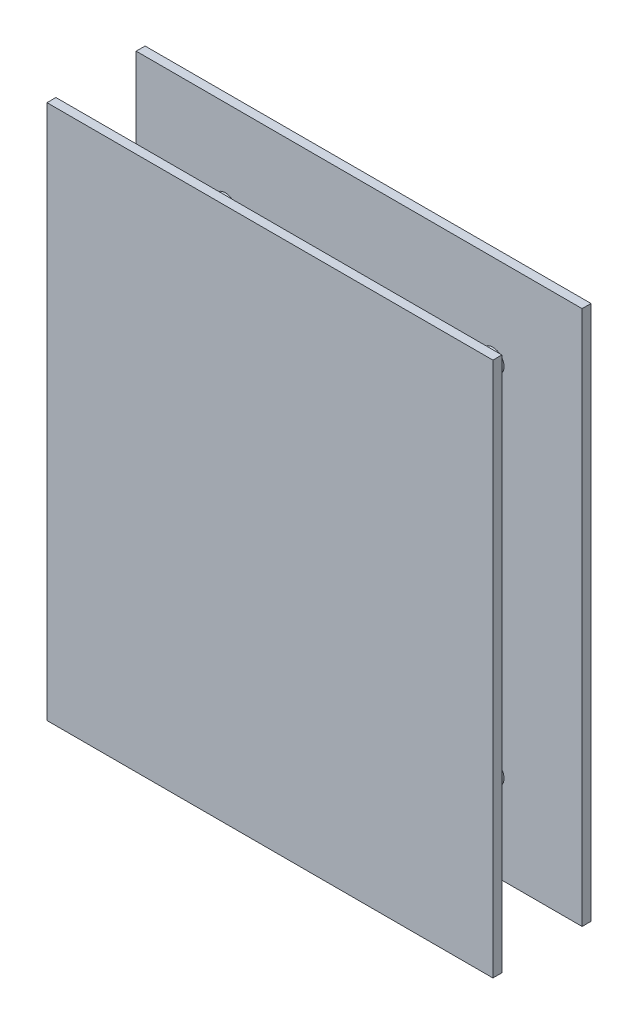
from build123d import *

# Parameters (mm, degrees)
ESQUISSE1_W             = 100
ESQUISSE1_H             = 120
BOSS_EXTRU_1_DEPTH      = 2
ESQUISSE2_R             = 2.5
BOSS_EXTRU_2_DEPTH      = 18
ESQUISSE5_W             = 100
ESQUISSE5_H             = 120
BOSS_EXTRU_3_DEPTH      = 2
ESQUISSE4_R             = 1.75
ENL_V_MAT_EXTRU_1_DEPTH = 10


with BuildPart() as part:
    # Esquisse1 → Boss.-Extru.1 (new body)
    with BuildSketch(Plane.XY):
        with Locations((50, 60)):
            Rectangle(ESQUISSE1_W, ESQUISSE1_H)
    extrude(amount=BOSS_EXTRU_1_DEPTH)

    # Esquisse2 → Boss.-Extru.2 (add)
    with BuildSketch(Plane.XY.offset(2)):
        with Locations(Location((20, 20, 0), (0, 0, 180))):
            Circle(ESQUISSE2_R)
        with Locations(Location((20, 100, 0), (0, 0, 180))):
            Circle(ESQUISSE2_R)
        with Locations(Location((80, 100, 0), (0, 0, 180))):
            Circle(ESQUISSE2_R)
        with Locations(Location((80, 20, 0), (0, 0, 180))):
            Circle(ESQUISSE2_R)
    extrude(amount=BOSS_EXTRU_2_DEPTH)

    # Esquisse5 → Boss.-Extru.3 (add)
    with BuildSketch(Plane.XY.offset(20)):
        with Locations((50, 60)):
            Rectangle(ESQUISSE5_W, ESQUISSE5_H)
    extrude(amount=BOSS_EXTRU_3_DEPTH)

    # Esquisse4 → Enl_v. mat.-Extru.1 (cut)
    with BuildSketch(Plane(origin=(0, 0, 0), x_dir=(-1, 0, 0), z_dir=(0, 0, -1))):
        with Locations((-75, 72.5)):
            Circle(ESQUISSE4_R)
        with Locations((-75, 47.5)):
            Circle(ESQUISSE4_R)
        with Locations((-25, 47.5)):
            Circle(ESQUISSE4_R)
        with Locations((-25, 72.5)):
            Circle(ESQUISSE4_R)
    extrude(amount=-ENL_V_MAT_EXTRU_1_DEPTH, mode=Mode.SUBTRACT)


solid = part.part
